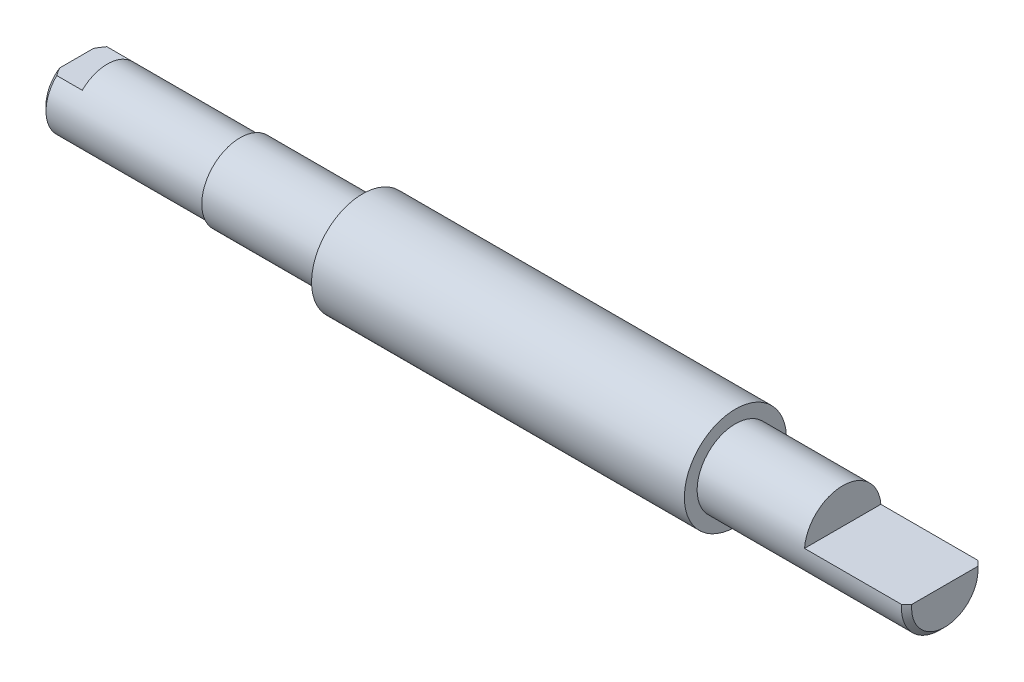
ISO-10303-21;
HEADER;
FILE_DESCRIPTION(('STEP AP214'),'2;1');
FILE_NAME('part.step','',(''),(''),'','','');
FILE_SCHEMA(('AUTOMOTIVE_DESIGN { 1 0 10303 214 1 1 1 1 }'));
ENDSEC;
DATA;
#1=APPLICATION_CONTEXT('core data for automotive mechanical design processes');
#2=APPLICATION_PROTOCOL_DEFINITION('international standard','automotive_design',2000,#1);
#3=PRODUCT_CONTEXT('',#1,'mechanical');
#4=PRODUCT('Part','Part','',(#3));
#5=PRODUCT_RELATED_PRODUCT_CATEGORY('part','',(#4));
#6=PRODUCT_DEFINITION_FORMATION('','',#4);
#7=PRODUCT_DEFINITION_CONTEXT('part definition',#1,'design');
#8=PRODUCT_DEFINITION('design','',#6,#7);
#9=PRODUCT_DEFINITION_SHAPE('','',#8);
#10=(LENGTH_UNIT() NAMED_UNIT(*) SI_UNIT(.MILLI.,.METRE.));
#11=(NAMED_UNIT(*) PLANE_ANGLE_UNIT() SI_UNIT($,.RADIAN.));
#12=(NAMED_UNIT(*) SI_UNIT($,.STERADIAN.) SOLID_ANGLE_UNIT());
#13=UNCERTAINTY_MEASURE_WITH_UNIT(LENGTH_MEASURE(1.E-05),#10,'distance_accuracy_value','');
#14=(GEOMETRIC_REPRESENTATION_CONTEXT(3) GLOBAL_UNCERTAINTY_ASSIGNED_CONTEXT((#13)) GLOBAL_UNIT_ASSIGNED_CONTEXT((#10,
#11,#12)) REPRESENTATION_CONTEXT('',''));
#15=CARTESIAN_POINT('',(0.,0.,0.));
#16=DIRECTION('',(0.,0.,1.));
#17=DIRECTION('',(1.,0.,0.));
#18=AXIS2_PLACEMENT_3D('',#15,#16,#17);
#19=CARTESIAN_POINT('',(0.,0.,0.));
#20=DIRECTION('',(1.,0.,0.));
#21=DIRECTION('',(0.,1.,0.));
#22=AXIS2_PLACEMENT_3D('',#19,#20,#21);
#23=CONICAL_SURFACE('',#22,5.99999999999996,0.785398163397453);
#24=CARTESIAN_POINT('',(6.26862357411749,5.,-11.203531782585));
#25=CARTESIAN_POINT('',(6.04852813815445,4.99999999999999,-10.962486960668));
#26=CARTESIAN_POINT('',(5.82904986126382,4.99999999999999,-10.7208748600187));
#27=CARTESIAN_POINT('',(5.39163906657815,4.99999999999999,-10.2362335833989));
#28=CARTESIAN_POINT('',(5.17370662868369,4.99999999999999,-9.99320433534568));
#29=CARTESIAN_POINT('',(4.73920886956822,4.99999999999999,-9.50489468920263));
#30=CARTESIAN_POINT('',(4.52264799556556,4.99999999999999,-9.25961032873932));
#31=CARTESIAN_POINT('',(4.0918741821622,4.99999999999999,-8.76699569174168));
#32=CARTESIAN_POINT('',(3.8776611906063,4.99999999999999,-8.51966546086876));
#33=CARTESIAN_POINT('',(3.43132624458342,4.99999999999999,-7.99811769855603));
#34=CARTESIAN_POINT('',(3.19950673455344,4.99999999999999,-7.72364076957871));
#35=CARTESIAN_POINT('',(2.74052879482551,4.99999999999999,-7.17081708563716));
#36=CARTESIAN_POINT('',(2.51337022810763,4.99999999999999,-6.89247044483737));
#37=CARTESIAN_POINT('',(2.06557878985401,4.99999999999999,-6.33105217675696));
#38=CARTESIAN_POINT('',(1.84493914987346,4.99999999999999,-6.04798596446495));
#39=CARTESIAN_POINT('',(1.41237402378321,4.99999999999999,-5.47527769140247));
#40=CARTESIAN_POINT('',(1.20044707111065,4.99999999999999,-5.18563675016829));
#41=CARTESIAN_POINT('',(0.894168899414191,4.99999999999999,-4.74763669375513));
#42=CARTESIAN_POINT('',(0.795022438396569,4.99999999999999,-4.60263165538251));
#43=CARTESIAN_POINT('',(0.600424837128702,4.99999999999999,-4.31016856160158));
#44=CARTESIAN_POINT('',(0.50497342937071,4.99999999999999,-4.16271068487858));
#45=CARTESIAN_POINT('',(0.318449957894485,4.99999999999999,-3.86475388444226));
#46=CARTESIAN_POINT('',(0.22738416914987,4.99999999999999,-3.71425101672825));
#47=CARTESIAN_POINT('',(0.0508407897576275,4.99999999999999,-3.40998986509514));
#48=CARTESIAN_POINT('',(-0.0346369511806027,4.99999999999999,-3.2562316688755));
#49=CARTESIAN_POINT('',(-0.196652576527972,4.99999999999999,-2.94881116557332));
#50=CARTESIAN_POINT('',(-0.273357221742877,4.99999999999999,-2.79523731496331));
#51=CARTESIAN_POINT('',(-0.418571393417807,4.99999999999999,-2.48420190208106));
#52=CARTESIAN_POINT('',(-0.487079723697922,4.99999999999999,-2.32673977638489));
#53=CARTESIAN_POINT('',(-0.613785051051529,4.99999999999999,-2.00813610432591));
#54=CARTESIAN_POINT('',(-0.672007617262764,4.99999999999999,-1.84700483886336));
#55=CARTESIAN_POINT('',(-0.776100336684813,4.99999999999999,-1.52084696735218));
#56=CARTESIAN_POINT('',(-0.821977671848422,5.,-1.35582268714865));
#57=CARTESIAN_POINT('',(-0.89799762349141,5.,-1.02722830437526));
#58=CARTESIAN_POINT('',(-0.928561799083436,4.99999999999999,-0.863757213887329));
#59=CARTESIAN_POINT('',(-0.974136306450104,4.99999999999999,-0.53463670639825));
#60=CARTESIAN_POINT('',(-0.989148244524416,4.99999999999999,-0.368987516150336));
#61=CARTESIAN_POINT('',(-1.00260018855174,4.99999999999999,-0.0373369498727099));
#62=CARTESIAN_POINT('',(-1.00107331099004,4.99999999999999,0.128663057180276));
#63=CARTESIAN_POINT('',(-0.981632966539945,4.99999999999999,0.459702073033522));
#64=CARTESIAN_POINT('',(-0.963717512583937,5.,0.62474096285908));
#65=CARTESIAN_POINT('',(-0.913032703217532,5.,0.950121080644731));
#66=CARTESIAN_POINT('',(-0.880473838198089,4.99999999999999,1.11049572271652));
#67=CARTESIAN_POINT('',(-0.802356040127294,4.99999999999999,1.42800764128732));
#68=CARTESIAN_POINT('',(-0.756796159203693,4.99999999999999,1.58514468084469));
#69=CARTESIAN_POINT('',(-0.653984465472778,4.99999999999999,1.89789587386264));
#70=CARTESIAN_POINT('',(-0.59658115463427,4.99999999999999,2.05345974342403));
#71=CARTESIAN_POINT('',(-0.503513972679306,4.99999999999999,2.28392091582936));
#72=CARTESIAN_POINT('',(-0.47133422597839,4.99999999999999,2.36025419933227));
#73=CARTESIAN_POINT('',(-0.404870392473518,4.99999999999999,2.51199617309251));
#74=CARTESIAN_POINT('',(-0.370586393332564,5.,2.58740490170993));
#75=CARTESIAN_POINT('',(-0.255942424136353,5.00000000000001,2.83133674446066));
#76=CARTESIAN_POINT('',(-0.171713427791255,4.99999999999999,2.998048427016));
#77=CARTESIAN_POINT('',(0.00436211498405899,4.99999999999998,3.32742190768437));
#78=CARTESIAN_POINT('',(0.096211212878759,4.99999999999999,3.49008232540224));
#79=CARTESIAN_POINT('',(0.286066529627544,4.99999999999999,3.81202710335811));
#80=CARTESIAN_POINT('',(0.38408029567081,4.99999999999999,3.97130699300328));
#81=CARTESIAN_POINT('',(0.58494078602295,4.99999999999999,4.28675015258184));
#82=CARTESIAN_POINT('',(0.687786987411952,4.99999999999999,4.44291375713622));
#83=CARTESIAN_POINT('',(0.898053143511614,4.99999999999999,4.7535558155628));
#84=CARTESIAN_POINT('',(1.00549778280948,4.99999999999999,4.90801750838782));
#85=CARTESIAN_POINT('',(1.22363181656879,4.99999999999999,5.21463674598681));
#86=CARTESIAN_POINT('',(1.33432137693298,4.99999999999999,5.36679417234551));
#87=CARTESIAN_POINT('',(1.67021742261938,4.99999999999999,5.82010228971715));
#88=CARTESIAN_POINT('',(1.89940069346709,4.99999999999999,6.11830601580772));
#89=CARTESIAN_POINT('',(2.34024938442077,4.99999999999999,6.67726553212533));
#90=CARTESIAN_POINT('',(2.55116758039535,4.99999999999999,6.93861602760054));
#91=CARTESIAN_POINT('',(2.97749248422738,4.99999999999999,7.45770029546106));
#92=CARTESIAN_POINT('',(3.19289995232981,4.99999999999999,7.715433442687));
#93=CARTESIAN_POINT('',(3.62422253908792,4.99999999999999,8.22458227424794));
#94=CARTESIAN_POINT('',(3.84009247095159,4.99999999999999,8.47603636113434));
#95=CARTESIAN_POINT('',(4.27442286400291,4.99999999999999,8.97657740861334));
#96=CARTESIAN_POINT('',(4.4928825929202,4.99999999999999,9.2256650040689));
#97=CARTESIAN_POINT('',(4.71233422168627,5.,9.47386428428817));
#98=B_SPLINE_CURVE_WITH_KNOTS('',3,(#24,#25,#26,#27,#28,#29,#30,#31,#32,#33,#34,#35,#36,#37,#38,
#39,#40,#41,#42,#43,#44,#45,#46,#47,#48,#49,#50,#51,#52,#53,#54,#55,#56,#57,#58,#59,#60,#61,#62,
#63,#64,#65,#66,#67,#68,#69,#70,#71,#72,#73,#74,#75,#76,#77,#78,#79,#80,#81,#82,#83,#84,#85,#86,
#87,#88,#89,#90,#91,#92,#93,#94,#95,#96,#97),.UNSPECIFIED.,.F.,.F.,(4,2,2,2,2,2,2,2,2,2,2,2,2,2,
2,2,2,2,2,2,2,2,2,2,2,2,2,2,2,2,2,2,2,2,2,2,4),(0.,0.979238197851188,1.95852664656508,
2.94012908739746,3.9217096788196,4.99949418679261,6.07724696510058,7.1538383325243,
8.23024773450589,8.75718463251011,9.28408331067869,9.81171474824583,10.3393319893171,
10.8541285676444,11.3690001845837,11.882573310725,12.3958470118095,12.8940850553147,
13.392271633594,13.8894608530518,14.3867103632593,14.8770299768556,15.3673853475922,
15.8644524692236,16.1129439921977,16.3614251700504,16.9214899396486,17.4817430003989,
18.0426958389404,18.6035881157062,19.1680057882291,19.7324523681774,20.8605551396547,
21.8680327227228,22.8756823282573,23.86987672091,24.8637964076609),.UNSPECIFIED.);
#99=CARTESIAN_POINT('',(0.999999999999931,4.99999999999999,-4.89897948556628));
#100=VERTEX_POINT('',#99);
#101=CARTESIAN_POINT('',(0.,5.,-3.31662479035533));
#102=VERTEX_POINT('',#101);
#103=EDGE_CURVE('E44',#100,#102,#98,.T.);
#104=ORIENTED_EDGE('',*,*,#103,.F.);
#105=CARTESIAN_POINT('',(1.,0.,0.));
#106=DIRECTION('',(1.,0.,0.));
#107=DIRECTION('',(0.,1.,0.));
#108=AXIS2_PLACEMENT_3D('',#105,#106,#107);
#109=CIRCLE('',#108,6.99999999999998);
#110=CARTESIAN_POINT('',(0.999999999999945,-5.00000000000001,-4.89897948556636));
#111=VERTEX_POINT('',#110);
#112=EDGE_CURVE('E129',#111,#100,#109,.T.);
#113=ORIENTED_EDGE('',*,*,#112,.F.);
#114=CARTESIAN_POINT('',(6.26862357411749,-5.,-11.2035317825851));
#115=CARTESIAN_POINT('',(6.04852813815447,-5.00000000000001,-10.9624869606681));
#116=CARTESIAN_POINT('',(5.82904986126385,-5.00000000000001,-10.7208748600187));
#117=CARTESIAN_POINT('',(5.39163906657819,-5.00000000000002,-10.2362335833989));
#118=CARTESIAN_POINT('',(5.17370662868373,-5.00000000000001,-9.99320433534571));
#119=CARTESIAN_POINT('',(4.73920886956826,-5.00000000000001,-9.50489468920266));
#120=CARTESIAN_POINT('',(4.5226479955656,-5.00000000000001,-9.25961032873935));
#121=CARTESIAN_POINT('',(4.09187418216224,-5.00000000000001,-8.76699569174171));
#122=CARTESIAN_POINT('',(3.87766119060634,-5.00000000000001,-8.51966546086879));
#123=CARTESIAN_POINT('',(3.43132624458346,-5.00000000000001,-7.99811769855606));
#124=CARTESIAN_POINT('',(3.19950673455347,-5.00000000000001,-7.72364076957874));
#125=CARTESIAN_POINT('',(2.74052879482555,-5.00000000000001,-7.17081708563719));
#126=CARTESIAN_POINT('',(2.51337022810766,-5.00000000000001,-6.8924704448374));
#127=CARTESIAN_POINT('',(2.06557878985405,-5.00000000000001,-6.33105217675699));
#128=CARTESIAN_POINT('',(1.84493914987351,-5.00000000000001,-6.04798596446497));
#129=CARTESIAN_POINT('',(1.41237402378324,-5.00000000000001,-5.47527769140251));
#130=CARTESIAN_POINT('',(1.20044707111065,-5.00000000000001,-5.18563675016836));
#131=CARTESIAN_POINT('',(0.894168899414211,-5.00000000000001,-4.74763669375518));
#132=CARTESIAN_POINT('',(0.795022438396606,-5.00000000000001,-4.60263165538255));
#133=CARTESIAN_POINT('',(0.600424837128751,-5.00000000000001,-4.31016856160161));
#134=CARTESIAN_POINT('',(0.504973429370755,-5.00000000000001,-4.16271068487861));
#135=CARTESIAN_POINT('',(0.318449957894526,-5.00000000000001,-3.8647538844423));
#136=CARTESIAN_POINT('',(0.227384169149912,-5.00000000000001,-3.71425101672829));
#137=CARTESIAN_POINT('',(0.0508407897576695,-5.00000000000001,-3.40998986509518));
#138=CARTESIAN_POINT('',(-0.0346369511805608,-5.00000000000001,-3.25623166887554));
#139=CARTESIAN_POINT('',(-0.19665257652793,-5.00000000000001,-2.94881116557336));
#140=CARTESIAN_POINT('',(-0.273357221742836,-5.00000000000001,-2.79523731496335));
#141=CARTESIAN_POINT('',(-0.418571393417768,-5.00000000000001,-2.48420190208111));
#142=CARTESIAN_POINT('',(-0.487079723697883,-5.00000000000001,-2.32673977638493));
#143=CARTESIAN_POINT('',(-0.613785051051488,-5.00000000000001,-2.00813610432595));
#144=CARTESIAN_POINT('',(-0.672007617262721,-5.00000000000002,-1.8470048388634));
#145=CARTESIAN_POINT('',(-0.776100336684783,-5.00000000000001,-1.52084696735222));
#146=CARTESIAN_POINT('',(-0.821977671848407,-5.,-1.3558226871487));
#147=CARTESIAN_POINT('',(-0.897997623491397,-5.,-1.02722830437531));
#148=CARTESIAN_POINT('',(-0.928561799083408,-5.00000000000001,-0.863757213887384));
#149=CARTESIAN_POINT('',(-0.974136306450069,-5.00000000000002,-0.534636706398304));
#150=CARTESIAN_POINT('',(-0.989148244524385,-5.00000000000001,-0.368987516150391));
#151=CARTESIAN_POINT('',(-1.00260018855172,-5.00000000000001,-0.0373369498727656));
#152=CARTESIAN_POINT('',(-1.00107331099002,-5.00000000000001,0.128663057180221));
#153=CARTESIAN_POINT('',(-0.981632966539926,-5.00000000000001,0.459702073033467));
#154=CARTESIAN_POINT('',(-0.963717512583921,-5.00000000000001,0.624740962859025));
#155=CARTESIAN_POINT('',(-0.91303270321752,-5.00000000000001,0.950121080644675));
#156=CARTESIAN_POINT('',(-0.880473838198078,-5.00000000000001,1.11049572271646));
#157=CARTESIAN_POINT('',(-0.802356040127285,-5.00000000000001,1.42800764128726));
#158=CARTESIAN_POINT('',(-0.756796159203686,-5.00000000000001,1.58514468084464));
#159=CARTESIAN_POINT('',(-0.653984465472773,-5.00000000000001,1.89789587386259));
#160=CARTESIAN_POINT('',(-0.596581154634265,-5.00000000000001,2.05345974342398));
#161=CARTESIAN_POINT('',(-0.503513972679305,-5.00000000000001,2.28392091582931));
#162=CARTESIAN_POINT('',(-0.471334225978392,-5.00000000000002,2.36025419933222));
#163=CARTESIAN_POINT('',(-0.404870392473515,-5.00000000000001,2.51199617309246));
#164=CARTESIAN_POINT('',(-0.370586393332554,-5.,2.58740490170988));
#165=CARTESIAN_POINT('',(-0.255942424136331,-4.99999999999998,2.8313367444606));
#166=CARTESIAN_POINT('',(-0.171713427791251,-5.,2.99804842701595));
#167=CARTESIAN_POINT('',(0.00436211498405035,-5.00000000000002,3.32742190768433));
#168=CARTESIAN_POINT('',(0.0962112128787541,-5.00000000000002,3.4900823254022));
#169=CARTESIAN_POINT('',(0.286066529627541,-5.00000000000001,3.81202710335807));
#170=CARTESIAN_POINT('',(0.384080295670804,-5.00000000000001,3.97130699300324));
#171=CARTESIAN_POINT('',(0.584940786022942,-5.00000000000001,4.2867501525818));
#172=CARTESIAN_POINT('',(0.687786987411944,-5.00000000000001,4.44291375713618));
#173=CARTESIAN_POINT('',(0.898053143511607,-5.00000000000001,4.75355581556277));
#174=CARTESIAN_POINT('',(1.00549778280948,-5.00000000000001,4.90801750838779));
#175=CARTESIAN_POINT('',(1.22363181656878,-5.00000000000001,5.21463674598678));
#176=CARTESIAN_POINT('',(1.33432137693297,-5.00000000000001,5.36679417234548));
#177=CARTESIAN_POINT('',(1.67021742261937,-5.00000000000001,5.82010228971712));
#178=CARTESIAN_POINT('',(1.89940069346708,-5.00000000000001,6.11830601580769));
#179=CARTESIAN_POINT('',(2.34024938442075,-5.00000000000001,6.6772655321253));
#180=CARTESIAN_POINT('',(2.55116758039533,-5.00000000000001,6.93861602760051));
#181=CARTESIAN_POINT('',(2.97749248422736,-5.00000000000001,7.45770029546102));
#182=CARTESIAN_POINT('',(3.1928999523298,-5.00000000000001,7.71543344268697));
#183=CARTESIAN_POINT('',(3.62422253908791,-5.00000000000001,8.2245822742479));
#184=CARTESIAN_POINT('',(3.84009247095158,-5.00000000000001,8.47603636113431));
#185=CARTESIAN_POINT('',(4.2744228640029,-5.00000000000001,8.97657740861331));
#186=CARTESIAN_POINT('',(4.49288259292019,-5.,9.22566500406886));
#187=CARTESIAN_POINT('',(4.71233422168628,-4.99999999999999,9.47386428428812));
#188=B_SPLINE_CURVE_WITH_KNOTS('',3,(#114,#115,#116,#117,#118,#119,#120,#121,#122,#123,#124,
#125,#126,#127,#128,#129,#130,#131,#132,#133,#134,#135,#136,#137,#138,#139,#140,#141,#142,#143,
#144,#145,#146,#147,#148,#149,#150,#151,#152,#153,#154,#155,#156,#157,#158,#159,#160,#161,#162,
#163,#164,#165,#166,#167,#168,#169,#170,#171,#172,#173,#174,#175,#176,#177,#178,#179,#180,#181,
#182,#183,#184,#185,#186,#187),.UNSPECIFIED.,.F.,.F.,(4,2,2,2,2,2,2,2,2,2,2,2,2,2,2,2,2,2,2,2,2,
2,2,2,2,2,2,2,2,2,2,2,2,2,2,2,4),(0.,0.979238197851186,1.95852664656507,2.94012908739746,
3.92170967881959,4.99949418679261,6.07724696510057,7.15383833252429,8.23024773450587,
8.75718463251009,9.28408331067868,9.81171474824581,10.3393319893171,10.8541285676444,
11.3690001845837,11.882573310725,12.3958470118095,12.8940850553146,13.3922716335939,
13.8894608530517,14.3867103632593,14.8770299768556,15.3673853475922,15.8644524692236,
16.1129439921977,16.3614251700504,16.9214899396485,17.4817430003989,18.0426958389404,
18.6035881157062,19.1680057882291,19.7324523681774,20.8605551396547,21.8680327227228,
22.8756823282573,23.86987672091,24.8637964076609),.UNSPECIFIED.);
#189=CARTESIAN_POINT('',(0.,-5.,-3.31662479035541));
#190=VERTEX_POINT('',#189);
#191=EDGE_CURVE('E120',#190,#111,#188,.F.);
#192=ORIENTED_EDGE('',*,*,#191,.F.);
#193=CARTESIAN_POINT('',(0.,0.,0.));
#194=DIRECTION('',(1.,0.,0.));
#195=DIRECTION('',(0.,1.,0.));
#196=AXIS2_PLACEMENT_3D('',#193,#194,#195);
#197=CIRCLE('',#196,5.99999999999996);
#198=EDGE_CURVE('E58',#102,#190,#197,.F.);
#199=ORIENTED_EDGE('',*,*,#198,.F.);
#200=EDGE_LOOP('',(#104,#113,#192,#199));
#201=FACE_BOUND('',#200,.T.);
#202=ADVANCED_FACE('F36',(#201),#23,.T.);
#203=CARTESIAN_POINT('',(0.,0.,0.));
#204=DIRECTION('',(1.,0.,0.));
#205=DIRECTION('',(0.,1.,0.));
#206=AXIS2_PLACEMENT_3D('',#203,#204,#205);
#207=PLANE('',#206);
#208=CARTESIAN_POINT('',(0.,-5.,3.31662479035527));
#209=VERTEX_POINT('',#208);
#210=CARTESIAN_POINT('',(0.,5.,3.31662479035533));
#211=VERTEX_POINT('',#210);
#212=EDGE_CURVE('E116',#209,#211,#197,.F.);
#213=ORIENTED_EDGE('',*,*,#212,.T.);
#214=DIRECTION('',(0.,0.,1.));
#215=VECTOR('',#214,1.);
#216=CARTESIAN_POINT('',(0.,5.,8.02912663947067));
#217=LINE('',#216,#215);
#218=EDGE_CURVE('E51',#102,#211,#217,.T.);
#219=ORIENTED_EDGE('',*,*,#218,.F.);
#220=ORIENTED_EDGE('',*,*,#198,.T.);
#221=DIRECTION('',(0.,0.,-1.));
#222=VECTOR('',#221,1.);
#223=CARTESIAN_POINT('',(0.,-5.,8.02912663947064));
#224=LINE('',#223,#222);
#225=EDGE_CURVE('E288',#209,#190,#224,.T.);
#226=ORIENTED_EDGE('',*,*,#225,.F.);
#227=EDGE_LOOP('',(#213,#219,#220,#226));
#228=FACE_BOUND('',#227,.T.);
#229=ADVANCED_FACE('F38',(#228),#207,.F.);
#230=CARTESIAN_POINT('',(-6.08948717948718,0.,0.));
#231=DIRECTION('',(-1.,0.,0.));
#232=DIRECTION('',(0.,-1.,0.));
#233=AXIS2_PLACEMENT_3D('',#230,#231,#232);
#234=CYLINDRICAL_SURFACE('',#233,6.99999999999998);
#235=CARTESIAN_POINT('',(6.00000000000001,0.,0.));
#236=DIRECTION('',(1.,0.,0.));
#237=DIRECTION('',(0.,1.,0.));
#238=AXIS2_PLACEMENT_3D('',#235,#236,#237);
#239=CIRCLE('',#238,6.99999999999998);
#240=CARTESIAN_POINT('',(5.99999999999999,5.,-4.89897948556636));
#241=VERTEX_POINT('',#240);
#242=CARTESIAN_POINT('',(5.99999999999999,5.,4.89897948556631));
#243=VERTEX_POINT('',#242);
#244=EDGE_CURVE('E11',#241,#243,#239,.T.);
#245=ORIENTED_EDGE('',*,*,#244,.T.);
#246=DIRECTION('',(-1.,0.,0.));
#247=VECTOR('',#246,1.);
#248=CARTESIAN_POINT('',(-6.08948717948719,5.,4.89897948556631));
#249=LINE('',#248,#247);
#250=CARTESIAN_POINT('',(0.999999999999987,5.,4.89897948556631));
#251=VERTEX_POINT('',#250);
#252=EDGE_CURVE('E291',#243,#251,#249,.T.);
#253=ORIENTED_EDGE('',*,*,#252,.T.);
#254=CARTESIAN_POINT('',(1.,-4.99999999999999,4.89897948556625));
#255=VERTEX_POINT('',#254);
#256=EDGE_CURVE('E123',#251,#255,#109,.T.);
#257=ORIENTED_EDGE('',*,*,#256,.T.);
#258=DIRECTION('',(-1.,0.,0.));
#259=VECTOR('',#258,1.);
#260=CARTESIAN_POINT('',(-6.08948717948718,-4.99999999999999,4.89897948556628));
#261=LINE('',#260,#259);
#262=CARTESIAN_POINT('',(6.00000000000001,-4.99999999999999,4.89897948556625));
#263=VERTEX_POINT('',#262);
#264=EDGE_CURVE('E279',#255,#263,#261,.F.);
#265=ORIENTED_EDGE('',*,*,#264,.T.);
#266=CARTESIAN_POINT('',(6.00000000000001,0.,0.));
#267=DIRECTION('',(1.,0.,0.));
#268=DIRECTION('',(0.,1.,0.));
#269=AXIS2_PLACEMENT_3D('',#266,#267,#268);
#270=CIRCLE('',#269,6.99999999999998);
#271=CARTESIAN_POINT('',(6.00000000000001,-5.,-4.89897948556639));
#272=VERTEX_POINT('',#271);
#273=EDGE_CURVE('E144',#263,#272,#270,.T.);
#274=ORIENTED_EDGE('',*,*,#273,.T.);
#275=DIRECTION('',(-1.,0.,0.));
#276=VECTOR('',#275,1.);
#277=CARTESIAN_POINT('',(-6.08948717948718,-5.,-4.89897948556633));
#278=LINE('',#277,#276);
#279=EDGE_CURVE('E281',#272,#111,#278,.T.);
#280=ORIENTED_EDGE('',*,*,#279,.T.);
#281=ORIENTED_EDGE('',*,*,#112,.T.);
#282=DIRECTION('',(-1.,0.,0.));
#283=VECTOR('',#282,1.);
#284=CARTESIAN_POINT('',(-6.08948717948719,5.,-4.89897948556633));
#285=LINE('',#284,#283);
#286=EDGE_CURVE('E109',#100,#241,#285,.F.);
#287=ORIENTED_EDGE('',*,*,#286,.T.);
#288=EDGE_LOOP('',(#245,#253,#257,#265,#274,#280,#281,#287));
#289=FACE_BOUND('',#288,.T.);
#290=CARTESIAN_POINT('',(32.,0.,0.));
#291=DIRECTION('',(-1.,0.,0.));
#292=DIRECTION('',(0.,-1.,0.));
#293=AXIS2_PLACEMENT_3D('',#290,#291,#292);
#294=CIRCLE('',#293,6.99999999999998);
#295=CARTESIAN_POINT('',(32.,-6.99999999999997,0.));
#296=VERTEX_POINT('',#295);
#297=EDGE_CURVE('E121',#296,#296,#294,.T.);
#298=ORIENTED_EDGE('',*,*,#297,.T.);
#299=EDGE_LOOP('',(#298));
#300=FACE_BOUND('',#299,.T.);
#301=ADVANCED_FACE('F185',(#289,#300),#234,.T.);
#302=CARTESIAN_POINT('',(32.,6.99999999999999,0.));
#303=DIRECTION('',(1.,0.,0.));
#304=DIRECTION('',(0.,1.,0.));
#305=AXIS2_PLACEMENT_3D('',#302,#303,#304);
#306=PLANE('',#305);
#307=ORIENTED_EDGE('',*,*,#297,.F.);
#308=EDGE_LOOP('',(#307));
#309=FACE_BOUND('',#308,.T.);
#310=CARTESIAN_POINT('',(32.,0.,0.));
#311=DIRECTION('',(-1.,0.,0.));
#312=DIRECTION('',(0.,-1.,0.));
#313=AXIS2_PLACEMENT_3D('',#310,#311,#312);
#314=CIRCLE('',#313,7.49999999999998);
#315=CARTESIAN_POINT('',(32.,-7.49999999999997,0.));
#316=VERTEX_POINT('',#315);
#317=EDGE_CURVE('E125',#316,#316,#314,.T.);
#318=ORIENTED_EDGE('',*,*,#317,.T.);
#319=EDGE_LOOP('',(#318));
#320=FACE_BOUND('',#319,.T.);
#321=ADVANCED_FACE('F189',(#309,#320),#306,.F.);
#322=CARTESIAN_POINT('',(-6.08948717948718,0.,0.));
#323=DIRECTION('',(-1.,0.,0.));
#324=DIRECTION('',(0.,-1.,0.));
#325=AXIS2_PLACEMENT_3D('',#322,#323,#324);
#326=CYLINDRICAL_SURFACE('',#325,7.49999999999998);
#327=ORIENTED_EDGE('',*,*,#317,.F.);
#328=EDGE_LOOP('',(#327));
#329=FACE_BOUND('',#328,.T.);
#330=CARTESIAN_POINT('',(56.,0.,0.));
#331=DIRECTION('',(-1.,0.,0.));
#332=DIRECTION('',(0.,-1.,0.));
#333=AXIS2_PLACEMENT_3D('',#330,#331,#332);
#334=CIRCLE('',#333,7.49999999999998);
#335=CARTESIAN_POINT('',(56.,-7.49999999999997,0.));
#336=VERTEX_POINT('',#335);
#337=EDGE_CURVE('E240',#336,#336,#334,.T.);
#338=ORIENTED_EDGE('',*,*,#337,.T.);
#339=EDGE_LOOP('',(#338));
#340=FACE_BOUND('',#339,.T.);
#341=ADVANCED_FACE('F194',(#329,#340),#326,.T.);
#342=CARTESIAN_POINT('',(56.,7.49999999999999,0.));
#343=DIRECTION('',(1.,0.,0.));
#344=DIRECTION('',(0.,1.,0.));
#345=AXIS2_PLACEMENT_3D('',#342,#343,#344);
#346=PLANE('',#345);
#347=ORIENTED_EDGE('',*,*,#337,.F.);
#348=EDGE_LOOP('',(#347));
#349=FACE_BOUND('',#348,.T.);
#350=CARTESIAN_POINT('',(56.,0.,0.));
#351=DIRECTION('',(-1.,0.,0.));
#352=DIRECTION('',(0.,-1.,0.));
#353=AXIS2_PLACEMENT_3D('',#350,#351,#352);
#354=CIRCLE('',#353,9.99999999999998);
#355=CARTESIAN_POINT('',(56.,-9.99999999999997,0.));
#356=VERTEX_POINT('',#355);
#357=EDGE_CURVE('E232',#356,#356,#354,.T.);
#358=ORIENTED_EDGE('',*,*,#357,.T.);
#359=EDGE_LOOP('',(#358));
#360=FACE_BOUND('',#359,.T.);
#361=ADVANCED_FACE('F201',(#349,#360),#346,.F.);
#362=CARTESIAN_POINT('',(-6.08948717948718,0.,0.));
#363=DIRECTION('',(-1.,0.,0.));
#364=DIRECTION('',(0.,-1.,0.));
#365=AXIS2_PLACEMENT_3D('',#362,#363,#364);
#366=CYLINDRICAL_SURFACE('',#365,9.99999999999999);
#367=ORIENTED_EDGE('',*,*,#357,.F.);
#368=EDGE_LOOP('',(#367));
#369=FACE_BOUND('',#368,.T.);
#370=CARTESIAN_POINT('',(129.,0.,0.));
#371=DIRECTION('',(-1.,0.,0.));
#372=DIRECTION('',(0.,-1.,0.));
#373=AXIS2_PLACEMENT_3D('',#370,#371,#372);
#374=CIRCLE('',#373,9.99999999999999);
#375=CARTESIAN_POINT('',(129.,-9.99999999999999,0.));
#376=VERTEX_POINT('',#375);
#377=EDGE_CURVE('E228',#376,#376,#374,.T.);
#378=ORIENTED_EDGE('',*,*,#377,.T.);
#379=EDGE_LOOP('',(#378));
#380=FACE_BOUND('',#379,.T.);
#381=ADVANCED_FACE('F205',(#369,#380),#366,.T.);
#382=CARTESIAN_POINT('',(129.,9.99999999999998,0.));
#383=DIRECTION('',(-1.,0.,0.));
#384=DIRECTION('',(0.,-1.,0.));
#385=AXIS2_PLACEMENT_3D('',#382,#383,#384);
#386=PLANE('',#385);
#387=ORIENTED_EDGE('',*,*,#377,.F.);
#388=EDGE_LOOP('',(#387));
#389=FACE_BOUND('',#388,.T.);
#390=CARTESIAN_POINT('',(129.,0.,0.));
#391=DIRECTION('',(-1.,0.,0.));
#392=DIRECTION('',(0.,-1.,0.));
#393=AXIS2_PLACEMENT_3D('',#390,#391,#392);
#394=CIRCLE('',#393,7.5);
#395=CARTESIAN_POINT('',(129.,-7.5,0.));
#396=VERTEX_POINT('',#395);
#397=EDGE_CURVE('E226',#396,#396,#394,.T.);
#398=ORIENTED_EDGE('',*,*,#397,.T.);
#399=EDGE_LOOP('',(#398));
#400=FACE_BOUND('',#399,.T.);
#401=ADVANCED_FACE('F209',(#389,#400),#386,.F.);
#402=CARTESIAN_POINT('',(-6.08948717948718,0.,0.));
#403=DIRECTION('',(-1.,0.,0.));
#404=DIRECTION('',(0.,-1.,0.));
#405=AXIS2_PLACEMENT_3D('',#402,#403,#404);
#406=CYLINDRICAL_SURFACE('',#405,7.5);
#407=CARTESIAN_POINT('',(169.,0.,0.));
#408=DIRECTION('',(-1.,0.,0.));
#409=DIRECTION('',(0.,-1.,0.));
#410=AXIS2_PLACEMENT_3D('',#407,#408,#409);
#411=CIRCLE('',#410,7.5);
#412=CARTESIAN_POINT('',(169.,0.599999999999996,-7.47596147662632));
#413=VERTEX_POINT('',#412);
#414=CARTESIAN_POINT('',(169.,0.600000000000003,7.47596147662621));
#415=VERTEX_POINT('',#414);
#416=EDGE_CURVE('E131',#413,#415,#411,.T.);
#417=ORIENTED_EDGE('',*,*,#416,.T.);
#418=DIRECTION('',(-1.,0.,0.));
#419=VECTOR('',#418,1.);
#420=CARTESIAN_POINT('',(-6.08948717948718,0.599999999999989,7.47596147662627));
#421=LINE('',#420,#419);
#422=CARTESIAN_POINT('',(150.,0.600000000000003,7.47596147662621));
#423=VERTEX_POINT('',#422);
#424=EDGE_CURVE('E256',#423,#415,#421,.F.);
#425=ORIENTED_EDGE('',*,*,#424,.F.);
#426=CARTESIAN_POINT('',(150.,0.,0.));
#427=DIRECTION('',(1.,0.,0.));
#428=DIRECTION('',(0.,0.,-1.));
#429=AXIS2_PLACEMENT_3D('',#426,#427,#428);
#430=CIRCLE('',#429,7.5);
#431=CARTESIAN_POINT('',(150.,0.599999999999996,-7.47596147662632));
#432=VERTEX_POINT('',#431);
#433=EDGE_CURVE('E277',#423,#432,#430,.F.);
#434=ORIENTED_EDGE('',*,*,#433,.T.);
#435=DIRECTION('',(-1.,0.,0.));
#436=VECTOR('',#435,1.);
#437=CARTESIAN_POINT('',(-6.08948717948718,0.599999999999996,-7.47596147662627));
#438=LINE('',#437,#436);
#439=EDGE_CURVE('E229',#413,#432,#438,.T.);
#440=ORIENTED_EDGE('',*,*,#439,.F.);
#441=EDGE_LOOP('',(#417,#425,#434,#440));
#442=FACE_BOUND('',#441,.T.);
#443=ORIENTED_EDGE('',*,*,#397,.F.);
#444=EDGE_LOOP('',(#443));
#445=FACE_BOUND('',#444,.T.);
#446=ADVANCED_FACE('F212',(#442,#445),#406,.T.);
#447=CARTESIAN_POINT('',(170.,7.5,0.));
#448=DIRECTION('',(-1.,0.,0.));
#449=DIRECTION('',(0.,-1.,0.));
#450=AXIS2_PLACEMENT_3D('',#447,#448,#449);
#451=PLANE('',#450);
#452=CARTESIAN_POINT('',(170.,0.,0.));
#453=DIRECTION('',(-1.,0.,0.));
#454=DIRECTION('',(0.,-1.,0.));
#455=AXIS2_PLACEMENT_3D('',#452,#453,#454);
#456=CIRCLE('',#455,6.49999999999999);
#457=CARTESIAN_POINT('',(170.,0.600000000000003,6.47224845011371));
#458=VERTEX_POINT('',#457);
#459=CARTESIAN_POINT('',(170.,0.600000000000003,-6.47224845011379));
#460=VERTEX_POINT('',#459);
#461=EDGE_CURVE('E134',#458,#460,#456,.F.);
#462=ORIENTED_EDGE('',*,*,#461,.T.);
#463=DIRECTION('',(0.,0.,-1.));
#464=VECTOR('',#463,1.);
#465=CARTESIAN_POINT('',(170.,0.600000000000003,-9.33760683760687));
#466=LINE('',#465,#464);
#467=EDGE_CURVE('E268',#458,#460,#466,.T.);
#468=ORIENTED_EDGE('',*,*,#467,.F.);
#469=EDGE_LOOP('',(#462,#468));
#470=FACE_BOUND('',#469,.T.);
#471=ADVANCED_FACE('F155',(#470),#451,.F.);
#472=EDGE_CURVE('E113',#211,#251,#98,.T.);
#473=ORIENTED_EDGE('',*,*,#472,.F.);
#474=ORIENTED_EDGE('',*,*,#212,.F.);
#475=EDGE_CURVE('E143',#255,#209,#188,.F.);
#476=ORIENTED_EDGE('',*,*,#475,.F.);
#477=ORIENTED_EDGE('',*,*,#256,.F.);
#478=EDGE_LOOP('',(#473,#474,#476,#477));
#479=FACE_BOUND('',#478,.T.);
#480=ADVANCED_FACE('F149',(#479),#23,.T.);
#481=CARTESIAN_POINT('',(169.,0.,0.));
#482=DIRECTION('',(-1.,0.,0.));
#483=DIRECTION('',(0.,-1.,0.));
#484=AXIS2_PLACEMENT_3D('',#481,#482,#483);
#485=CONICAL_SURFACE('',#484,7.5,0.785398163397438);
#486=CARTESIAN_POINT('',(164.083513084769,0.599999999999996,-12.4019815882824));
#487=CARTESIAN_POINT('',(164.552279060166,0.600000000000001,-11.9326608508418));
#488=CARTESIAN_POINT('',(165.021019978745,0.600000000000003,-11.4633150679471));
#489=CARTESIAN_POINT('',(165.958406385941,0.600000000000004,-10.5245375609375));
#490=CARTESIAN_POINT('',(166.427051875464,0.600000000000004,-10.055105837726));
#491=CARTESIAN_POINT('',(167.36419855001,0.600000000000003,-9.11612417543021));
#492=CARTESIAN_POINT('',(167.832699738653,0.600000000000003,-8.64657423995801));
#493=CARTESIAN_POINT('',(168.769497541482,0.600000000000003,-7.70726121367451));
#494=CARTESIAN_POINT('',(169.237794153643,0.600000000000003,-7.23749812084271));
#495=CARTESIAN_POINT('',(169.939973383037,0.600000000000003,-6.53256224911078));
#496=CARTESIAN_POINT('',(170.173995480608,0.600000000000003,-6.297528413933));
#497=CARTESIAN_POINT('',(170.641907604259,0.600000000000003,-5.82733107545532));
#498=CARTESIAN_POINT('',(170.875797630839,0.600000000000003,-5.59216757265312));
#499=CARTESIAN_POINT('',(171.343381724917,0.600000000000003,-5.12165965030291));
#500=CARTESIAN_POINT('',(171.577075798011,0.600000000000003,-4.88631523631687));
#501=CARTESIAN_POINT('',(172.044182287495,0.600000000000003,-4.41534052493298));
#502=CARTESIAN_POINT('',(172.277594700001,0.600000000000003,-4.17971022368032));
#503=CARTESIAN_POINT('',(172.627373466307,0.600000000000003,-3.82590449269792));
#504=CARTESIAN_POINT('',(172.743915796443,0.600000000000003,-3.7079030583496));
#505=CARTESIAN_POINT('',(172.976842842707,0.600000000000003,-3.47174559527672));
#506=CARTESIAN_POINT('',(173.09322755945,0.600000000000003,-3.35358956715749));
#507=CARTESIAN_POINT('',(173.325778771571,0.600000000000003,-3.11707327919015));
#508=CARTESIAN_POINT('',(173.441945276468,0.600000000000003,-2.99871302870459));
#509=CARTESIAN_POINT('',(173.673980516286,0.600000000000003,-2.76169748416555));
#510=CARTESIAN_POINT('',(173.789849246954,0.600000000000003,-2.64304218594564));
#511=CARTESIAN_POINT('',(174.02116377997,0.600000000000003,-2.40528286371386));
#512=CARTESIAN_POINT('',(174.136609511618,0.600000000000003,-2.28617877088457));
#513=CARTESIAN_POINT('',(174.366815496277,0.600000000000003,-2.04731712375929));
#514=CARTESIAN_POINT('',(174.481575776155,0.600000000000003,-1.92755959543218));
#515=CARTESIAN_POINT('',(174.652854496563,0.600000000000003,-1.74708331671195));
#516=CARTESIAN_POINT('',(174.70980906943,0.600000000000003,-1.68677888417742));
#517=CARTESIAN_POINT('',(174.823314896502,0.600000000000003,-1.56579385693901));
#518=CARTESIAN_POINT('',(174.879866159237,0.600000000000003,-1.50511327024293));
#519=CARTESIAN_POINT('',(174.992427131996,0.600000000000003,-1.38323387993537));
#520=CARTESIAN_POINT('',(175.048436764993,0.600000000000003,-1.32203500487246));
#521=CARTESIAN_POINT('',(175.159615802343,0.600000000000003,-1.1988716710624));
#522=CARTESIAN_POINT('',(175.214785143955,0.600000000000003,-1.13690715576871));
#523=CARTESIAN_POINT('',(175.269384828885,0.600000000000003,-1.07443645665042));
#524=B_SPLINE_CURVE_WITH_KNOTS('',3,(#486,#487,#488,#489,#490,#491,#492,#493,#494,#495,#496,
#497,#498,#499,#500,#501,#502,#503,#504,#505,#506,#507,#508,#509,#510,#511,#512,#513,#514,#515,
#516,#517,#518,#519,#520,#521,#522,#523),.UNSPECIFIED.,.F.,.F.,(4,2,2,2,2,2,2,2,2,2,2,2,2,2,2,2,
2,2,4),(0.,1.9899827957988,3.97994575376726,5.96985390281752,7.95978132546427,8.95480149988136,
9.94981788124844,10.9448048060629,11.9398052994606,12.4373572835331,12.9349073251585,
13.4324351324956,13.9299700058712,14.4275845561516,14.9251794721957,15.1740234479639,
15.4228621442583,15.671735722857,15.9206277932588),.UNSPECIFIED.);
#525=EDGE_CURVE('E234',#413,#460,#524,.T.);
#526=ORIENTED_EDGE('',*,*,#525,.T.);
#527=ORIENTED_EDGE('',*,*,#461,.F.);
#528=CARTESIAN_POINT('',(175.269384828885,0.600000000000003,1.07443645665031));
#529=CARTESIAN_POINT('',(175.22983372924,0.600000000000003,1.11971748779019));
#530=CARTESIAN_POINT('',(175.189967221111,0.600000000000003,1.16471983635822));
#531=CARTESIAN_POINT('',(175.109742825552,0.600000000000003,1.25428116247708));
#532=CARTESIAN_POINT('',(175.069384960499,0.600000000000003,1.29884016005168));
#533=CARTESIAN_POINT('',(174.947787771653,0.600000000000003,1.43201855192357));
#534=CARTESIAN_POINT('',(174.866015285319,0.600000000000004,1.52015016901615));
#535=CARTESIAN_POINT('',(174.701632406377,0.600000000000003,1.69559894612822));
#536=CARTESIAN_POINT('',(174.61902214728,0.6,1.78291623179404));
#537=CARTESIAN_POINT('',(174.453239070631,0.600000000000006,1.95702119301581));
#538=CARTESIAN_POINT('',(174.370066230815,0.600000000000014,2.04380884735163));
#539=CARTESIAN_POINT('',(174.120068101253,0.600000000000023,2.3035431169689));
#540=CARTESIAN_POINT('',(173.952680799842,0.600000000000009,2.47594814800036));
#541=CARTESIAN_POINT('',(173.61712391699,0.599999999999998,2.81999565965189));
#542=CARTESIAN_POINT('',(173.448954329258,0.600000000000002,2.99163813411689));
#543=CARTESIAN_POINT('',(173.112141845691,0.600000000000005,3.33445722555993));
#544=CARTESIAN_POINT('',(172.94349895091,0.600000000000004,3.50563384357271));
#545=CARTESIAN_POINT('',(172.605908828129,0.600000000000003,3.84768679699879));
#546=CARTESIAN_POINT('',(172.436961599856,0.600000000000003,4.01856313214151));
#547=CARTESIAN_POINT('',(171.929763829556,0.600000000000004,4.53094292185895));
#548=CARTESIAN_POINT('',(171.591208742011,0.600000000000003,4.87214484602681));
#549=CARTESIAN_POINT('',(170.913683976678,0.600000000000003,5.55413334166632));
#550=CARTESIAN_POINT('',(170.574714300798,0.600000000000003,5.89491991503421));
#551=CARTESIAN_POINT('',(170.147347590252,0.600000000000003,6.32425989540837));
#552=CARTESIAN_POINT('',(170.059067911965,0.600000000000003,6.41293012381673));
#553=CARTESIAN_POINT('',(169.882495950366,0.600000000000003,6.59025234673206));
#554=CARTESIAN_POINT('',(169.794203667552,0.600000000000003,6.67890434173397));
#555=CARTESIAN_POINT('',(169.237836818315,0.600000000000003,7.23745471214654));
#556=CARTESIAN_POINT('',(168.769583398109,0.600000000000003,7.70717493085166));
#557=CARTESIAN_POINT('',(167.832867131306,0.600000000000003,8.64640659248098));
#558=CARTESIAN_POINT('',(167.364404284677,0.600000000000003,9.11591803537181));
#559=CARTESIAN_POINT('',(166.427252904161,0.600000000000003,10.0549044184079));
#560=CARTESIAN_POINT('',(165.958564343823,0.600000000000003,10.5243793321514));
#561=CARTESIAN_POINT('',(165.021096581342,0.600000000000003,11.4632383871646));
#562=CARTESIAN_POINT('',(164.552317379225,0.600000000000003,11.9326225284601));
#563=CARTESIAN_POINT('',(164.083513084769,0.600000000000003,12.4019815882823));
#564=B_SPLINE_CURVE_WITH_KNOTS('',3,(#528,#529,#530,#531,#532,#533,#534,#535,#536,#537,#538,
#539,#540,#541,#542,#543,#544,#545,#546,#547,#548,#549,#550,#551,#552,#553,#554,#555,#556,#557,
#558,#559,#560,#561,#562,#563),.UNSPECIFIED.,.F.,.F.,(4,2,2,2,2,2,2,2,2,2,2,2,2,2,2,2,2,4),(0.,
0.180361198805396,0.360714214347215,0.721376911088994,1.08198300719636,1.44260345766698,
2.16348464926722,2.88437164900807,3.60525704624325,4.32614309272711,5.76813550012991,
7.21012129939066,7.58548964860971,7.96084591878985,9.95059076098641,11.9403359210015,
13.9304818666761,15.9206272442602),.UNSPECIFIED.);
#565=EDGE_CURVE('E262',#458,#415,#564,.T.);
#566=ORIENTED_EDGE('',*,*,#565,.T.);
#567=ORIENTED_EDGE('',*,*,#416,.F.);
#568=EDGE_LOOP('',(#526,#527,#566,#567));
#569=FACE_BOUND('',#568,.T.);
#570=ADVANCED_FACE('F154',(#569),#485,.T.);
#571=CARTESIAN_POINT('',(150.,10.001,12.3148148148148));
#572=DIRECTION('',(1.,0.,0.));
#573=DIRECTION('',(0.,0.,-1.));
#574=AXIS2_PLACEMENT_3D('',#571,#572,#573);
#575=PLANE('',#574);
#576=DIRECTION('',(0.,0.,1.));
#577=VECTOR('',#576,1.);
#578=CARTESIAN_POINT('',(150.,0.600000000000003,12.3148148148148));
#579=LINE('',#578,#577);
#580=EDGE_CURVE('E269',#432,#423,#579,.T.);
#581=ORIENTED_EDGE('',*,*,#580,.F.);
#582=ORIENTED_EDGE('',*,*,#433,.F.);
#583=EDGE_LOOP('',(#581,#582));
#584=FACE_BOUND('',#583,.T.);
#585=ADVANCED_FACE('F177',(#584),#575,.T.);
#586=CARTESIAN_POINT('',(150.,0.600000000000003,-9.33760683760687));
#587=DIRECTION('',(0.,-1.,0.));
#588=DIRECTION('',(0.,0.,-1.));
#589=AXIS2_PLACEMENT_3D('',#586,#587,#588);
#590=PLANE('',#589);
#591=ORIENTED_EDGE('',*,*,#439,.T.);
#592=ORIENTED_EDGE('',*,*,#580,.T.);
#593=ORIENTED_EDGE('',*,*,#424,.T.);
#594=ORIENTED_EDGE('',*,*,#565,.F.);
#595=ORIENTED_EDGE('',*,*,#467,.T.);
#596=ORIENTED_EDGE('',*,*,#525,.F.);
#597=EDGE_LOOP('',(#591,#592,#593,#594,#595,#596));
#598=FACE_BOUND('',#597,.T.);
#599=ADVANCED_FACE('F170',(#598),#590,.F.);
#600=CARTESIAN_POINT('',(6.00000000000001,-11.0218449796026,8.0291266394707));
#601=DIRECTION('',(1.,0.,0.));
#602=DIRECTION('',(0.,1.,0.));
#603=AXIS2_PLACEMENT_3D('',#600,#601,#602);
#604=PLANE('',#603);
#605=DIRECTION('',(0.,0.,-1.));
#606=VECTOR('',#605,1.);
#607=CARTESIAN_POINT('',(6.00000000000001,-5.00000000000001,8.02912663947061));
#608=LINE('',#607,#606);
#609=EDGE_CURVE('E286',#263,#272,#608,.T.);
#610=ORIENTED_EDGE('',*,*,#609,.T.);
#611=ORIENTED_EDGE('',*,*,#273,.F.);
#612=EDGE_LOOP('',(#610,#611));
#613=FACE_BOUND('',#612,.T.);
#614=ADVANCED_FACE('F168',(#613),#604,.F.);
#615=CARTESIAN_POINT('',(6.00000000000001,-5.00000000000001,8.02912663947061));
#616=DIRECTION('',(0.,1.,0.));
#617=DIRECTION('',(0.,0.,1.));
#618=AXIS2_PLACEMENT_3D('',#615,#616,#617);
#619=PLANE('',#618);
#620=ORIENTED_EDGE('',*,*,#475,.T.);
#621=ORIENTED_EDGE('',*,*,#225,.T.);
#622=ORIENTED_EDGE('',*,*,#191,.T.);
#623=ORIENTED_EDGE('',*,*,#279,.F.);
#624=ORIENTED_EDGE('',*,*,#609,.F.);
#625=ORIENTED_EDGE('',*,*,#264,.F.);
#626=EDGE_LOOP('',(#620,#621,#622,#623,#624,#625));
#627=FACE_BOUND('',#626,.T.);
#628=ADVANCED_FACE('F145',(#627),#619,.F.);
#629=CARTESIAN_POINT('',(5.99999999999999,5.,-8.53094705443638));
#630=DIRECTION('',(1.,0.,0.));
#631=DIRECTION('',(0.,1.,0.));
#632=AXIS2_PLACEMENT_3D('',#629,#630,#631);
#633=PLANE('',#632);
#634=DIRECTION('',(0.,0.,1.));
#635=VECTOR('',#634,1.);
#636=CARTESIAN_POINT('',(5.99999999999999,4.99999999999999,8.02912663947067));
#637=LINE('',#636,#635);
#638=EDGE_CURVE('E117',#241,#243,#637,.T.);
#639=ORIENTED_EDGE('',*,*,#638,.T.);
#640=ORIENTED_EDGE('',*,*,#244,.F.);
#641=EDGE_LOOP('',(#639,#640));
#642=FACE_BOUND('',#641,.T.);
#643=ADVANCED_FACE('F167',(#642),#633,.F.);
#644=CARTESIAN_POINT('',(5.99999999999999,4.99999999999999,8.02912663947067));
#645=DIRECTION('',(0.,-1.,0.));
#646=DIRECTION('',(0.,0.,-1.));
#647=AXIS2_PLACEMENT_3D('',#644,#645,#646);
#648=PLANE('',#647);
#649=ORIENTED_EDGE('',*,*,#103,.T.);
#650=ORIENTED_EDGE('',*,*,#218,.T.);
#651=ORIENTED_EDGE('',*,*,#472,.T.);
#652=ORIENTED_EDGE('',*,*,#252,.F.);
#653=ORIENTED_EDGE('',*,*,#638,.F.);
#654=ORIENTED_EDGE('',*,*,#286,.F.);
#655=EDGE_LOOP('',(#649,#650,#651,#652,#653,#654));
#656=FACE_BOUND('',#655,.T.);
#657=ADVANCED_FACE('F106',(#656),#648,.F.);
#658=CLOSED_SHELL('',(#202,#229,#301,#321,#341,#361,#381,#401,#446,#471,#480,#570,#585,#599,
#614,#628,#643,#657));
#659=MANIFOLD_SOLID_BREP('B2',#658);
#660=ADVANCED_BREP_SHAPE_REPRESENTATION('',(#18,#659),#14);
#661=SHAPE_DEFINITION_REPRESENTATION(#9,#660);
ENDSEC;
END-ISO-10303-21;
